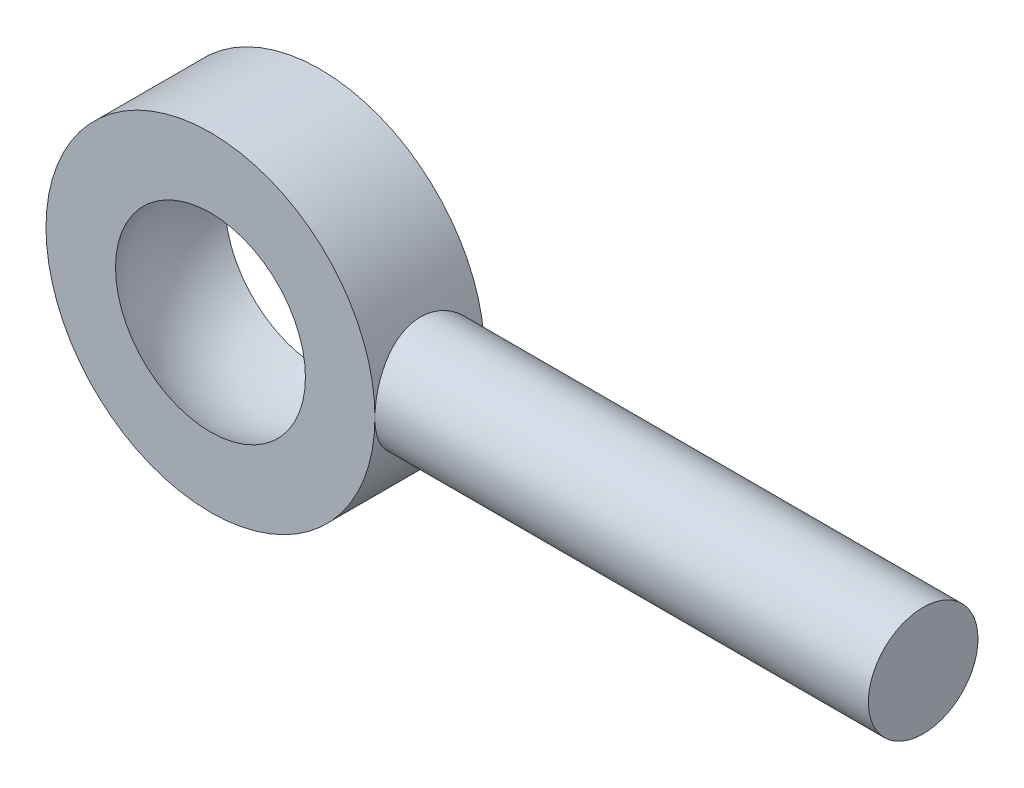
from build123d import *

# Parameters (mm, degrees)
BASE_EXTRUDE_DEPTH      = 3.175
BASE_EXTRUDE_DEPTH_BACK = 3.175
SKETCH1_R               = 9.525
SKETCH15_R              = 3.175
BOSS_EXTRUDE3_DEPTH     = 31.75


with BuildPart() as part:
    # Sketch1 → Base-Extrude (new, two sides: drawn at the far end of the back side and taken through both)
    with BuildSketch(Plane.XY.offset(-BASE_EXTRUDE_DEPTH_BACK)):
        Circle(SKETCH1_R)
    extrude(amount=BASE_EXTRUDE_DEPTH + BASE_EXTRUDE_DEPTH_BACK)

    # Sketch4 → Cut-Revolve1 (revolve, cut)
    with BuildSketch(Plane(origin=(0, 0, 0), x_dir=(1, 0, 0), z_dir=(0, 1, 0))):
        with BuildLine():
            Line((0, 6.35), (0, -6.35))
            ThreePointArc((0, -6.35), (6.35, 0), (0, 6.35))
        make_face()
    revolve(axis=Axis((0, 0, -15.24), (0, 0, 1)), mode=Mode.SUBTRACT)

    # Sketch15 → Boss-Extrude3 (add)
    with BuildSketch(Plane(origin=(6.35, 0, 0), x_dir=(0, 0, -1), z_dir=(1, 0, 0))):
        Circle(SKETCH15_R)
    extrude(amount=BOSS_EXTRUDE3_DEPTH)


solid = part.part
